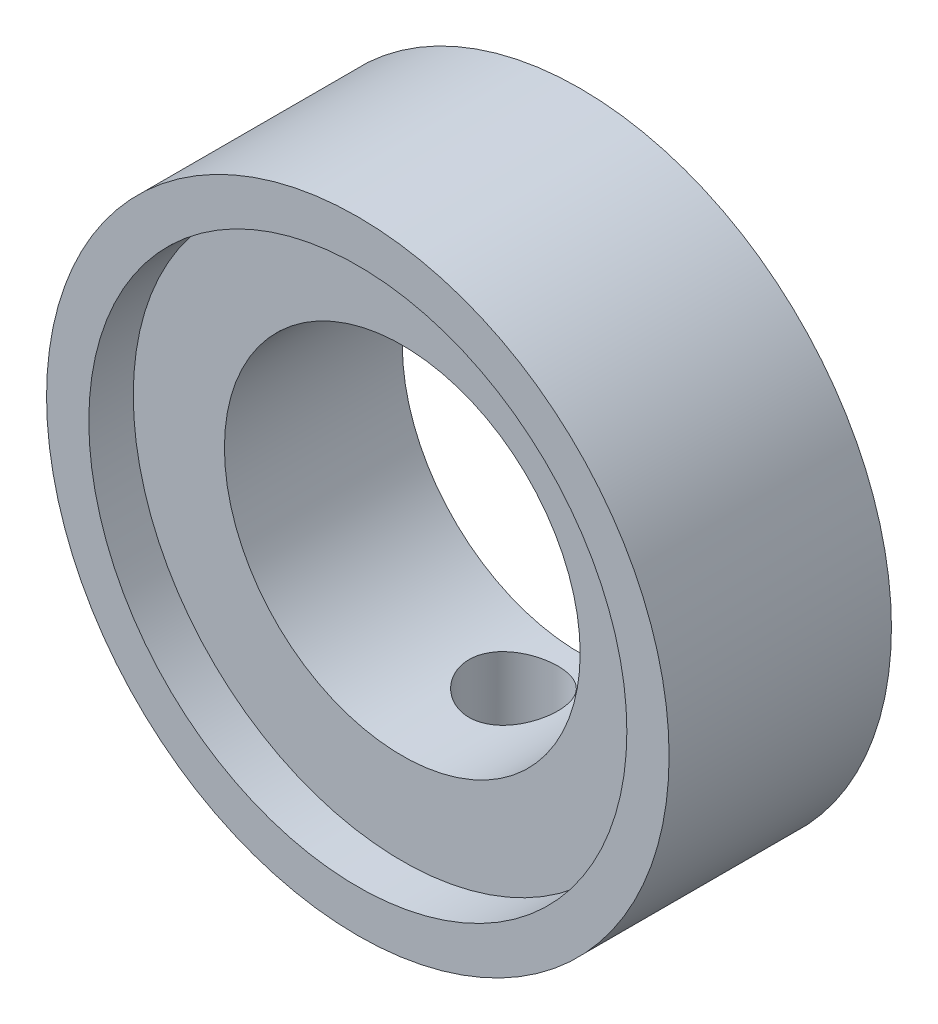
from build123d import *

# Parameters (mm, degrees)
SKICA1_R                 = 126.95
SKICA1_R_2               = 122.5
P_IDAT_VYSUNUT_M1_DEPTH  = 5
SKICA2_R                 = 137
SKICA2_R_2               = 122.5
P_IDAT_VYSUNUT_M2_DEPTH  = 38
SKICA3_R                 = 137
SKICA3_R_2               = 25.25
P_IDAT_VYSUNUT_M3_DEPTH  = 5
SKICA4_R                 = 35
SKICA4_R_2               = 20
P_IDAT_VYSUNUT_M4_DEPTH  = 25
SKICA5_R                 = 30.25
ODEBRAT_VYSUNUT_M1_DEPTH = 5
SKICA6_W                 = 18.14
SKICA6_H                 = 6.19
ODEBRAT_VYSUNUT_M2_DEPTH = 65
SKICA8_R                 = 5
ODEBRAT_VYSUNUT_M3_DEPTH = 65
SKICA9_R                 = 45
SKICA9_R_2               = 40
P_IDAT_VYSUNUT_M5_DEPTH  = 18
M_TKO1_SCALE             = 0.655
SKICA14_R                = 165.5762168
ODEBRAT_VYSUNUT_M5_DEPTH = 130.992336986


with BuildPart() as part:
    # Skica1 → P_idat vysunut_m1 (new body)
    with BuildSketch(Plane.XY):
        Circle(SKICA1_R)
        Circle(SKICA1_R_2, mode=Mode.SUBTRACT)
    extrude(amount=P_IDAT_VYSUNUT_M1_DEPTH)


with BuildPart() as body_2:
    # Skica2 → P_idat vysunut_m2 (new body)
    with BuildSketch(Plane.XY.offset(5)):
        Circle(SKICA2_R)
        Circle(SKICA2_R_2, mode=Mode.SUBTRACT)
    extrude(amount=P_IDAT_VYSUNUT_M2_DEPTH)

    # Skica3 → P_idat vysunut_m3 (add)
    with BuildSketch(Plane.XY.offset(43)):
        Circle(SKICA3_R)
        Circle(SKICA3_R_2, mode=Mode.SUBTRACT)
    extrude(amount=-P_IDAT_VYSUNUT_M3_DEPTH)

    # Skica4 → P_idat vysunut_m4 (add)
    with BuildSketch(Plane.XY.offset(43)):
        Circle(SKICA4_R)
        Circle(SKICA4_R_2, mode=Mode.SUBTRACT)
    extrude(amount=P_IDAT_VYSUNUT_M4_DEPTH)

    # Skica5 → Odebrat vysunut_m1 (cut)
    with BuildSketch(Plane.XY.offset(68)):
        Circle(SKICA5_R)
    extrude(amount=-ODEBRAT_VYSUNUT_M1_DEPTH, mode=Mode.SUBTRACT)

    # Skica6 → Odebrat vysunut_m2 (cut)
    with BuildSketch(Plane.XY.offset(43)):
        with Locations((0, -131.905)):
            Rectangle(SKICA6_W, SKICA6_H)
    extrude(amount=-ODEBRAT_VYSUNUT_M2_DEPTH, mode=Mode.SUBTRACT)

    # Skica8 → Odebrat vysunut_m3 (cut)
    with BuildSketch(Plane(origin=(0, 0, 0), x_dir=(1, 0, 0), z_dir=(0, 1, 0))):
        with Locations(Location((0, -50.5, 0), (0, 0, 270))):
            Circle(SKICA8_R)
    extrude(amount=-ODEBRAT_VYSUNUT_M3_DEPTH, mode=Mode.SUBTRACT)

    # Skica9 → P_idat vysunut_m5 (add)
    with BuildSketch(Plane(origin=(0, 0, 38), x_dir=(-1, 0, 0), z_dir=(0, 0, -1))):
        with Locations(Location((0, 0, 0), (0, 0, 180))):
            Circle(SKICA9_R)
        Circle(SKICA9_R_2, mode=Mode.SUBTRACT)
    extrude(amount=P_IDAT_VYSUNUT_M5_DEPTH)


with BuildPart() as part_1:
    # M_tko1: scaled about (0, 0, 0)
    add(part.part.scale(M_TKO1_SCALE))


with BuildPart() as body_2_1:
    # M_tko1: scaled about (0, 0, 0)
    add(body_2.part.scale(M_TKO1_SCALE))


with BuildPart() as odebrat_vysunut_m5_tool:
    # Skica14 → Odebrat vysunut_m5 (new, through all)
    with BuildSketch(Plane.XY.offset(28.165)):
        Circle(SKICA14_R)
    extrude(amount=-ODEBRAT_VYSUNUT_M5_DEPTH)


with BuildPart() as part_2:
    add(part_1.part)

    # Odebrat vysunut_m5: cut by odebrat_vysunut_m5_tool
    add(odebrat_vysunut_m5_tool.part, mode=Mode.SUBTRACT)


with BuildPart() as body_2_2:
    add(body_2_1.part)

    # Odebrat vysunut_m5: cut by odebrat_vysunut_m5_tool
    add(odebrat_vysunut_m5_tool.part, mode=Mode.SUBTRACT)


solid = body_2_2.part
